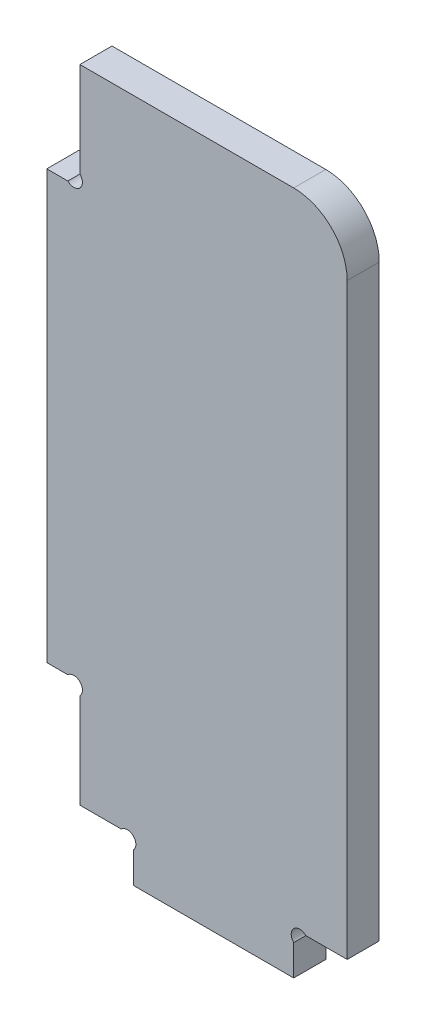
from build123d import *

# Parameters (mm, degrees)
EXTRUSION1_DEPTH = 6


with BuildPart() as part:
    # Esquisse1 → Extrusion1 (new body)
    with BuildSketch(Plane.XY):
        with BuildLine():
            Line((6.2, 130), (46.2, 130))
            ThreePointArc((46.2, 130), (53.271067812, 127.071067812), (56.2, 120))
            Line((56.2, 120), (56.2, 10))
            Line((56.2, 10), (48.4627417, 10))
            ThreePointArc((48.4627417, 10), (46.2, 10), (46.2, 7.7372583))
            Line((46.2, 7.7372583), (46.2, 2))
            Line((46.2, 2), (16.2, 2))
            Line((16.2, 2), (16.2, 7.7372583))
            ThreePointArc((16.2, 7.7372583), (16.2, 10), (13.9372583, 10))
            Line((13.9372583, 10), (6.2, 10))
            Line((6.2, 10), (6.2, 27.7372583))
            ThreePointArc((6.2, 27.7372583), (6.2, 30), (3.9372583, 30))
            Line((3.9372583, 30), (0, 30))
            Line((0, 30), (0, 110))
            Line((0, 110), (3.9372583, 110))
            ThreePointArc((3.9372583, 110), (6.2, 110), (6.2, 112.2627417))
            Line((6.2, 112.2627417), (6.2, 130))
        make_face()
    extrude(amount=EXTRUSION1_DEPTH)


solid = part.part
